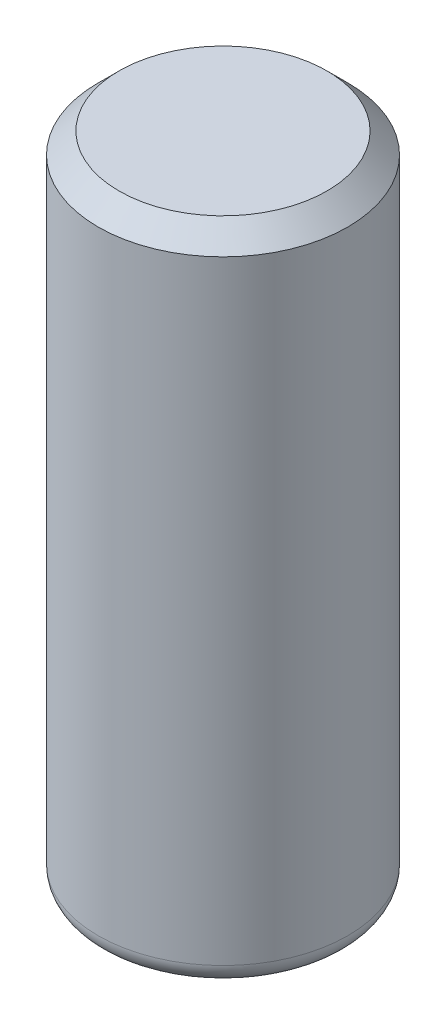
ISO-10303-21;
HEADER;
FILE_DESCRIPTION(('STEP AP214'),'2;1');
FILE_NAME('part.step','',(''),(''),'','','');
FILE_SCHEMA(('AUTOMOTIVE_DESIGN { 1 0 10303 214 1 1 1 1 }'));
ENDSEC;
DATA;
#1=APPLICATION_CONTEXT('core data for automotive mechanical design processes');
#2=APPLICATION_PROTOCOL_DEFINITION('international standard','automotive_design',2000,#1);
#3=PRODUCT_CONTEXT('',#1,'mechanical');
#4=PRODUCT('Part','Part','',(#3));
#5=PRODUCT_RELATED_PRODUCT_CATEGORY('part','',(#4));
#6=PRODUCT_DEFINITION_FORMATION('','',#4);
#7=PRODUCT_DEFINITION_CONTEXT('part definition',#1,'design');
#8=PRODUCT_DEFINITION('design','',#6,#7);
#9=PRODUCT_DEFINITION_SHAPE('','',#8);
#10=(LENGTH_UNIT() NAMED_UNIT(*) SI_UNIT(.MILLI.,.METRE.));
#11=(NAMED_UNIT(*) PLANE_ANGLE_UNIT() SI_UNIT($,.RADIAN.));
#12=(NAMED_UNIT(*) SI_UNIT($,.STERADIAN.) SOLID_ANGLE_UNIT());
#13=UNCERTAINTY_MEASURE_WITH_UNIT(LENGTH_MEASURE(1.E-05),#10,'distance_accuracy_value','');
#14=(GEOMETRIC_REPRESENTATION_CONTEXT(3) GLOBAL_UNCERTAINTY_ASSIGNED_CONTEXT((#13)) GLOBAL_UNIT_ASSIGNED_CONTEXT((#10,
#11,#12)) REPRESENTATION_CONTEXT('',''));
#15=CARTESIAN_POINT('',(0.,0.,0.));
#16=DIRECTION('',(0.,0.,1.));
#17=DIRECTION('',(1.,0.,0.));
#18=AXIS2_PLACEMENT_3D('',#15,#16,#17);
#19=CARTESIAN_POINT('',(0.,0.,0.));
#20=DIRECTION('',(0.,-1.,0.));
#21=DIRECTION('',(0.,0.,-1.));
#22=AXIS2_PLACEMENT_3D('',#19,#20,#21);
#23=PLANE('',#22);
#24=CARTESIAN_POINT('',(0.,0.,0.));
#25=DIRECTION('',(0.,-1.,0.));
#26=DIRECTION('',(0.,0.,-1.));
#27=AXIS2_PLACEMENT_3D('',#24,#25,#26);
#28=CIRCLE('',#27,1.27);
#29=CARTESIAN_POINT('',(0.,0.,-1.27));
#30=VERTEX_POINT('',#29);
#31=EDGE_CURVE('E41',#30,#30,#28,.T.);
#32=ORIENTED_EDGE('',*,*,#31,.T.);
#33=EDGE_LOOP('',(#32));
#34=FACE_BOUND('',#33,.T.);
#35=ADVANCED_FACE('F30',(#34),#23,.T.);
#36=CARTESIAN_POINT('',(0.,7.98295478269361,0.));
#37=DIRECTION('',(0.,1.,0.));
#38=DIRECTION('',(0.,0.,1.));
#39=AXIS2_PLACEMENT_3D('',#36,#37,#38);
#40=CYLINDRICAL_SURFACE('',#39,1.524);
#41=CARTESIAN_POINT('',(0.,7.747,0.));
#42=DIRECTION('',(0.,1.,0.));
#43=DIRECTION('',(0.,0.,1.));
#44=AXIS2_PLACEMENT_3D('',#41,#42,#43);
#45=CIRCLE('',#44,1.524);
#46=CARTESIAN_POINT('',(0.,7.747,1.524));
#47=VERTEX_POINT('',#46);
#48=EDGE_CURVE('E10',#47,#47,#45,.F.);
#49=ORIENTED_EDGE('',*,*,#48,.T.);
#50=EDGE_LOOP('',(#49));
#51=FACE_BOUND('',#50,.T.);
#52=CARTESIAN_POINT('',(0.,0.254,0.));
#53=DIRECTION('',(0.,-1.,0.));
#54=DIRECTION('',(0.,0.,-1.));
#55=AXIS2_PLACEMENT_3D('',#52,#53,#54);
#56=CIRCLE('',#55,1.524);
#57=CARTESIAN_POINT('',(0.,0.254,-1.524));
#58=VERTEX_POINT('',#57);
#59=EDGE_CURVE('E45',#58,#58,#56,.F.);
#60=ORIENTED_EDGE('',*,*,#59,.T.);
#61=EDGE_LOOP('',(#60));
#62=FACE_BOUND('',#61,.T.);
#63=ADVANCED_FACE('F51',(#51,#62),#40,.T.);
#64=CARTESIAN_POINT('',(-1.524,8.001,0.));
#65=DIRECTION('',(0.,1.,0.));
#66=DIRECTION('',(0.,0.,1.));
#67=AXIS2_PLACEMENT_3D('',#64,#65,#66);
#68=PLANE('',#67);
#69=CARTESIAN_POINT('',(0.,8.001,0.));
#70=DIRECTION('',(0.,1.,0.));
#71=DIRECTION('',(0.,0.,1.));
#72=AXIS2_PLACEMENT_3D('',#69,#70,#71);
#73=CIRCLE('',#72,1.27);
#74=CARTESIAN_POINT('',(0.,8.001,1.27));
#75=VERTEX_POINT('',#74);
#76=EDGE_CURVE('E37',#75,#75,#73,.T.);
#77=ORIENTED_EDGE('',*,*,#76,.T.);
#78=EDGE_LOOP('',(#77));
#79=FACE_BOUND('',#78,.T.);
#80=ADVANCED_FACE('F55',(#79),#68,.T.);
#81=CARTESIAN_POINT('',(0.,0.254,0.));
#82=DIRECTION('',(0.,-1.,0.));
#83=DIRECTION('',(0.,0.,-1.));
#84=AXIS2_PLACEMENT_3D('',#81,#82,#83);
#85=TOROIDAL_SURFACE('',#84,1.27,0.254);
#86=ORIENTED_EDGE('',*,*,#31,.F.);
#87=EDGE_LOOP('',(#86));
#88=FACE_BOUND('',#87,.T.);
#89=ORIENTED_EDGE('',*,*,#59,.F.);
#90=EDGE_LOOP('',(#89));
#91=FACE_BOUND('',#90,.T.);
#92=ADVANCED_FACE('F53',(#88,#91),#85,.T.);
#93=CARTESIAN_POINT('',(0.,8.001,0.));
#94=DIRECTION('',(0.,-1.,0.));
#95=DIRECTION('',(0.,0.,-1.));
#96=AXIS2_PLACEMENT_3D('',#93,#94,#95);
#97=CONICAL_SURFACE('',#96,1.27,0.785398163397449);
#98=ORIENTED_EDGE('',*,*,#48,.F.);
#99=EDGE_LOOP('',(#98));
#100=FACE_BOUND('',#99,.T.);
#101=ORIENTED_EDGE('',*,*,#76,.F.);
#102=EDGE_LOOP('',(#101));
#103=FACE_BOUND('',#102,.T.);
#104=ADVANCED_FACE('F32',(#100,#103),#97,.T.);
#105=CLOSED_SHELL('',(#35,#63,#80,#92,#104));
#106=MANIFOLD_SOLID_BREP('B2',#105);
#107=ADVANCED_BREP_SHAPE_REPRESENTATION('',(#18,#106),#14);
#108=SHAPE_DEFINITION_REPRESENTATION(#9,#107);
ENDSEC;
END-ISO-10303-21;
